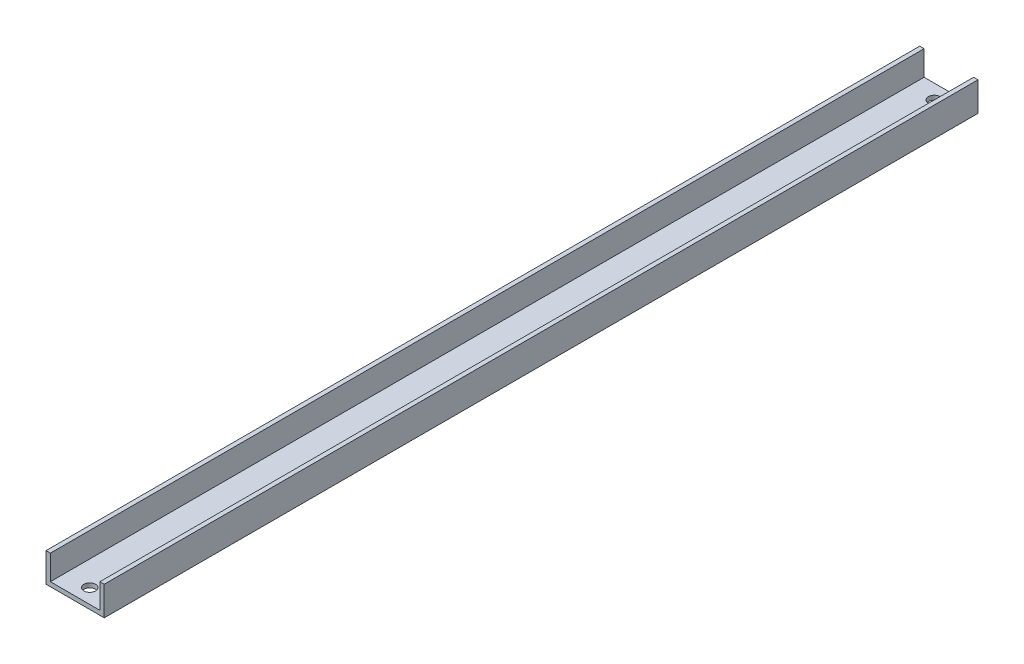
ISO-10303-21;
HEADER;
FILE_DESCRIPTION(('STEP AP214'),'2;1');
FILE_NAME('part.step','',(''),(''),'','','');
FILE_SCHEMA(('AUTOMOTIVE_DESIGN { 1 0 10303 214 1 1 1 1 }'));
ENDSEC;
DATA;
#1=APPLICATION_CONTEXT('core data for automotive mechanical design processes');
#2=APPLICATION_PROTOCOL_DEFINITION('international standard','automotive_design',2000,#1);
#3=PRODUCT_CONTEXT('',#1,'mechanical');
#4=PRODUCT('Part','Part','',(#3));
#5=PRODUCT_RELATED_PRODUCT_CATEGORY('part','',(#4));
#6=PRODUCT_DEFINITION_FORMATION('','',#4);
#7=PRODUCT_DEFINITION_CONTEXT('part definition',#1,'design');
#8=PRODUCT_DEFINITION('design','',#6,#7);
#9=PRODUCT_DEFINITION_SHAPE('','',#8);
#10=(LENGTH_UNIT() NAMED_UNIT(*) SI_UNIT(.MILLI.,.METRE.));
#11=(NAMED_UNIT(*) PLANE_ANGLE_UNIT() SI_UNIT($,.RADIAN.));
#12=(NAMED_UNIT(*) SI_UNIT($,.STERADIAN.) SOLID_ANGLE_UNIT());
#13=UNCERTAINTY_MEASURE_WITH_UNIT(LENGTH_MEASURE(1.E-05),#10,'distance_accuracy_value','');
#14=(GEOMETRIC_REPRESENTATION_CONTEXT(3) GLOBAL_UNCERTAINTY_ASSIGNED_CONTEXT((#13)) GLOBAL_UNIT_ASSIGNED_CONTEXT((#10,
#11,#12)) REPRESENTATION_CONTEXT('',''));
#15=CARTESIAN_POINT('',(0.,0.,0.));
#16=DIRECTION('',(0.,0.,1.));
#17=DIRECTION('',(1.,0.,0.));
#18=AXIS2_PLACEMENT_3D('',#15,#16,#17);
#19=CARTESIAN_POINT('',(-10.,0.,300.));
#20=DIRECTION('',(1.,0.,0.));
#21=DIRECTION('',(0.,0.,-1.));
#22=AXIS2_PLACEMENT_3D('',#19,#20,#21);
#23=PLANE('',#22);
#24=DIRECTION('',(0.,-1.,0.));
#25=VECTOR('',#24,1.);
#26=CARTESIAN_POINT('',(-10.,0.,0.));
#27=LINE('',#26,#25);
#28=CARTESIAN_POINT('',(-10.,10.,0.));
#29=VERTEX_POINT('',#28);
#30=CARTESIAN_POINT('',(-10.,0.,0.));
#31=VERTEX_POINT('',#30);
#32=EDGE_CURVE('E96',#29,#31,#27,.T.);
#33=ORIENTED_EDGE('',*,*,#32,.T.);
#34=DIRECTION('',(0.,0.,-1.));
#35=VECTOR('',#34,1.);
#36=CARTESIAN_POINT('',(-10.,0.,300.));
#37=LINE('',#36,#35);
#38=CARTESIAN_POINT('',(-10.,0.,300.));
#39=VERTEX_POINT('',#38);
#40=EDGE_CURVE('E11',#39,#31,#37,.T.);
#41=ORIENTED_EDGE('',*,*,#40,.F.);
#42=DIRECTION('',(0.,-1.,0.));
#43=VECTOR('',#42,1.);
#44=CARTESIAN_POINT('',(-10.,0.,300.));
#45=LINE('',#44,#43);
#46=CARTESIAN_POINT('',(-10.,10.,300.));
#47=VERTEX_POINT('',#46);
#48=EDGE_CURVE('E128',#47,#39,#45,.T.);
#49=ORIENTED_EDGE('',*,*,#48,.F.);
#50=DIRECTION('',(0.,0.,-1.));
#51=VECTOR('',#50,1.);
#52=CARTESIAN_POINT('',(-10.,10.,300.));
#53=LINE('',#52,#51);
#54=EDGE_CURVE('E109',#47,#29,#53,.T.);
#55=ORIENTED_EDGE('',*,*,#54,.T.);
#56=EDGE_LOOP('',(#33,#41,#49,#55));
#57=FACE_BOUND('',#56,.T.);
#58=ADVANCED_FACE('F26',(#57),#23,.F.);
#59=CARTESIAN_POINT('',(10.,0.,300.));
#60=DIRECTION('',(0.,1.,0.));
#61=DIRECTION('',(0.,0.,1.));
#62=AXIS2_PLACEMENT_3D('',#59,#60,#61);
#63=PLANE('',#62);
#64=CARTESIAN_POINT('',(0.,0.,295.));
#65=DIRECTION('',(0.,-1.,0.));
#66=DIRECTION('',(0.,0.,-1.));
#67=AXIS2_PLACEMENT_3D('',#64,#65,#66);
#68=CIRCLE('',#67,2.);
#69=CARTESIAN_POINT('',(0.,0.,293.));
#70=VERTEX_POINT('',#69);
#71=EDGE_CURVE('E228',#70,#70,#68,.T.);
#72=ORIENTED_EDGE('',*,*,#71,.F.);
#73=EDGE_LOOP('',(#72));
#74=FACE_BOUND('',#73,.T.);
#75=CARTESIAN_POINT('',(0.,0.,5.));
#76=DIRECTION('',(0.,-1.,0.));
#77=DIRECTION('',(0.,0.,-1.));
#78=AXIS2_PLACEMENT_3D('',#75,#76,#77);
#79=CIRCLE('',#78,2.);
#80=CARTESIAN_POINT('',(0.,0.,3.));
#81=VERTEX_POINT('',#80);
#82=EDGE_CURVE('E113',#81,#81,#79,.T.);
#83=ORIENTED_EDGE('',*,*,#82,.F.);
#84=EDGE_LOOP('',(#83));
#85=FACE_BOUND('',#84,.T.);
#86=DIRECTION('',(1.,0.,0.));
#87=VECTOR('',#86,1.);
#88=CARTESIAN_POINT('',(10.,0.,0.));
#89=LINE('',#88,#87);
#90=CARTESIAN_POINT('',(10.,0.,0.));
#91=VERTEX_POINT('',#90);
#92=EDGE_CURVE('E92',#31,#91,#89,.T.);
#93=ORIENTED_EDGE('',*,*,#92,.T.);
#94=DIRECTION('',(0.,0.,-1.));
#95=VECTOR('',#94,1.);
#96=CARTESIAN_POINT('',(10.,0.,300.));
#97=LINE('',#96,#95);
#98=CARTESIAN_POINT('',(10.,0.,300.));
#99=VERTEX_POINT('',#98);
#100=EDGE_CURVE('E34',#99,#91,#97,.T.);
#101=ORIENTED_EDGE('',*,*,#100,.F.);
#102=DIRECTION('',(1.,0.,0.));
#103=VECTOR('',#102,1.);
#104=CARTESIAN_POINT('',(10.,0.,300.));
#105=LINE('',#104,#103);
#106=EDGE_CURVE('E105',#39,#99,#105,.T.);
#107=ORIENTED_EDGE('',*,*,#106,.F.);
#108=ORIENTED_EDGE('',*,*,#40,.T.);
#109=EDGE_LOOP('',(#93,#101,#107,#108));
#110=FACE_BOUND('',#109,.T.);
#111=ADVANCED_FACE('F104',(#74,#85,#110),#63,.F.);
#112=CARTESIAN_POINT('',(10.,0.,300.));
#113=DIRECTION('',(-1.,0.,0.));
#114=DIRECTION('',(0.,0.,1.));
#115=AXIS2_PLACEMENT_3D('',#112,#113,#114);
#116=PLANE('',#115);
#117=DIRECTION('',(0.,1.,0.));
#118=VECTOR('',#117,1.);
#119=CARTESIAN_POINT('',(10.,0.,0.));
#120=LINE('',#119,#118);
#121=CARTESIAN_POINT('',(10.,10.,0.));
#122=VERTEX_POINT('',#121);
#123=EDGE_CURVE('E98',#91,#122,#120,.T.);
#124=ORIENTED_EDGE('',*,*,#123,.T.);
#125=DIRECTION('',(0.,0.,-1.));
#126=VECTOR('',#125,1.);
#127=CARTESIAN_POINT('',(10.,10.,300.));
#128=LINE('',#127,#126);
#129=CARTESIAN_POINT('',(10.,10.,300.));
#130=VERTEX_POINT('',#129);
#131=EDGE_CURVE('E154',#130,#122,#128,.T.);
#132=ORIENTED_EDGE('',*,*,#131,.F.);
#133=DIRECTION('',(0.,1.,0.));
#134=VECTOR('',#133,1.);
#135=CARTESIAN_POINT('',(10.,0.,300.));
#136=LINE('',#135,#134);
#137=EDGE_CURVE('E131',#99,#130,#136,.T.);
#138=ORIENTED_EDGE('',*,*,#137,.F.);
#139=ORIENTED_EDGE('',*,*,#100,.T.);
#140=EDGE_LOOP('',(#124,#132,#138,#139));
#141=FACE_BOUND('',#140,.T.);
#142=ADVANCED_FACE('F159',(#141),#116,.F.);
#143=CARTESIAN_POINT('',(10.,10.,300.));
#144=DIRECTION('',(0.,-1.,0.));
#145=DIRECTION('',(0.,0.,-1.));
#146=AXIS2_PLACEMENT_3D('',#143,#144,#145);
#147=PLANE('',#146);
#148=DIRECTION('',(-1.,0.,0.));
#149=VECTOR('',#148,1.);
#150=CARTESIAN_POINT('',(10.,10.,0.));
#151=LINE('',#150,#149);
#152=CARTESIAN_POINT('',(8.5,10.,0.));
#153=VERTEX_POINT('',#152);
#154=EDGE_CURVE('E118',#122,#153,#151,.T.);
#155=ORIENTED_EDGE('',*,*,#154,.T.);
#156=DIRECTION('',(0.,0.,-1.));
#157=VECTOR('',#156,1.);
#158=CARTESIAN_POINT('',(8.5,10.,300.));
#159=LINE('',#158,#157);
#160=CARTESIAN_POINT('',(8.5,10.,300.));
#161=VERTEX_POINT('',#160);
#162=EDGE_CURVE('E151',#161,#153,#159,.T.);
#163=ORIENTED_EDGE('',*,*,#162,.F.);
#164=DIRECTION('',(-1.,0.,0.));
#165=VECTOR('',#164,1.);
#166=CARTESIAN_POINT('',(10.,10.,300.));
#167=LINE('',#166,#165);
#168=EDGE_CURVE('E133',#130,#161,#167,.T.);
#169=ORIENTED_EDGE('',*,*,#168,.F.);
#170=ORIENTED_EDGE('',*,*,#131,.T.);
#171=EDGE_LOOP('',(#155,#163,#169,#170));
#172=FACE_BOUND('',#171,.T.);
#173=ADVANCED_FACE('F167',(#172),#147,.F.);
#174=CARTESIAN_POINT('',(8.5,1.5,300.));
#175=DIRECTION('',(1.,0.,0.));
#176=DIRECTION('',(0.,0.,-1.));
#177=AXIS2_PLACEMENT_3D('',#174,#175,#176);
#178=PLANE('',#177);
#179=DIRECTION('',(0.,-1.,0.));
#180=VECTOR('',#179,1.);
#181=CARTESIAN_POINT('',(8.5,1.5,0.));
#182=LINE('',#181,#180);
#183=CARTESIAN_POINT('',(8.5,1.5,0.));
#184=VERTEX_POINT('',#183);
#185=EDGE_CURVE('E120',#153,#184,#182,.T.);
#186=ORIENTED_EDGE('',*,*,#185,.T.);
#187=DIRECTION('',(0.,0.,-1.));
#188=VECTOR('',#187,1.);
#189=CARTESIAN_POINT('',(8.5,1.5,300.));
#190=LINE('',#189,#188);
#191=CARTESIAN_POINT('',(8.5,1.5,300.));
#192=VERTEX_POINT('',#191);
#193=EDGE_CURVE('E148',#192,#184,#190,.T.);
#194=ORIENTED_EDGE('',*,*,#193,.F.);
#195=DIRECTION('',(0.,-1.,0.));
#196=VECTOR('',#195,1.);
#197=CARTESIAN_POINT('',(8.5,1.5,300.));
#198=LINE('',#197,#196);
#199=EDGE_CURVE('E135',#161,#192,#198,.T.);
#200=ORIENTED_EDGE('',*,*,#199,.F.);
#201=ORIENTED_EDGE('',*,*,#162,.T.);
#202=EDGE_LOOP('',(#186,#194,#200,#201));
#203=FACE_BOUND('',#202,.T.);
#204=ADVANCED_FACE('F170',(#203),#178,.F.);
#205=CARTESIAN_POINT('',(8.5,1.5,300.));
#206=DIRECTION('',(0.,-1.,0.));
#207=DIRECTION('',(0.,0.,-1.));
#208=AXIS2_PLACEMENT_3D('',#205,#206,#207);
#209=PLANE('',#208);
#210=CARTESIAN_POINT('',(0.,1.5,295.));
#211=DIRECTION('',(0.,-1.,0.));
#212=DIRECTION('',(0.,0.,-1.));
#213=AXIS2_PLACEMENT_3D('',#210,#211,#212);
#214=CIRCLE('',#213,2.);
#215=CARTESIAN_POINT('',(0.,1.5,293.));
#216=VERTEX_POINT('',#215);
#217=EDGE_CURVE('E29',#216,#216,#214,.T.);
#218=ORIENTED_EDGE('',*,*,#217,.T.);
#219=EDGE_LOOP('',(#218));
#220=FACE_BOUND('',#219,.T.);
#221=CARTESIAN_POINT('',(0.,1.5,5.));
#222=DIRECTION('',(0.,-1.,0.));
#223=DIRECTION('',(0.,0.,-1.));
#224=AXIS2_PLACEMENT_3D('',#221,#222,#223);
#225=CIRCLE('',#224,2.);
#226=CARTESIAN_POINT('',(0.,1.5,3.));
#227=VERTEX_POINT('',#226);
#228=EDGE_CURVE('E110',#227,#227,#225,.T.);
#229=ORIENTED_EDGE('',*,*,#228,.T.);
#230=EDGE_LOOP('',(#229));
#231=FACE_BOUND('',#230,.T.);
#232=DIRECTION('',(-1.,0.,0.));
#233=VECTOR('',#232,1.);
#234=CARTESIAN_POINT('',(8.5,1.5,0.));
#235=LINE('',#234,#233);
#236=CARTESIAN_POINT('',(-8.5,1.5,0.));
#237=VERTEX_POINT('',#236);
#238=EDGE_CURVE('E122',#184,#237,#235,.T.);
#239=ORIENTED_EDGE('',*,*,#238,.T.);
#240=DIRECTION('',(0.,0.,-1.));
#241=VECTOR('',#240,1.);
#242=CARTESIAN_POINT('',(-8.5,1.5,300.));
#243=LINE('',#242,#241);
#244=CARTESIAN_POINT('',(-8.5,1.5,300.));
#245=VERTEX_POINT('',#244);
#246=EDGE_CURVE('E145',#245,#237,#243,.T.);
#247=ORIENTED_EDGE('',*,*,#246,.F.);
#248=DIRECTION('',(-1.,0.,0.));
#249=VECTOR('',#248,1.);
#250=CARTESIAN_POINT('',(8.5,1.5,300.));
#251=LINE('',#250,#249);
#252=EDGE_CURVE('E137',#192,#245,#251,.T.);
#253=ORIENTED_EDGE('',*,*,#252,.F.);
#254=ORIENTED_EDGE('',*,*,#193,.T.);
#255=EDGE_LOOP('',(#239,#247,#253,#254));
#256=FACE_BOUND('',#255,.T.);
#257=ADVANCED_FACE('F175',(#220,#231,#256),#209,.F.);
#258=CARTESIAN_POINT('',(-8.5,1.5,300.));
#259=DIRECTION('',(-1.,0.,0.));
#260=DIRECTION('',(0.,0.,1.));
#261=AXIS2_PLACEMENT_3D('',#258,#259,#260);
#262=PLANE('',#261);
#263=DIRECTION('',(0.,1.,0.));
#264=VECTOR('',#263,1.);
#265=CARTESIAN_POINT('',(-8.5,1.5,0.));
#266=LINE('',#265,#264);
#267=CARTESIAN_POINT('',(-8.5,10.,0.));
#268=VERTEX_POINT('',#267);
#269=EDGE_CURVE('E124',#237,#268,#266,.T.);
#270=ORIENTED_EDGE('',*,*,#269,.T.);
#271=DIRECTION('',(0.,0.,-1.));
#272=VECTOR('',#271,1.);
#273=CARTESIAN_POINT('',(-8.5,10.,300.));
#274=LINE('',#273,#272);
#275=CARTESIAN_POINT('',(-8.5,10.,300.));
#276=VERTEX_POINT('',#275);
#277=EDGE_CURVE('E142',#276,#268,#274,.T.);
#278=ORIENTED_EDGE('',*,*,#277,.F.);
#279=DIRECTION('',(0.,1.,0.));
#280=VECTOR('',#279,1.);
#281=CARTESIAN_POINT('',(-8.5,1.5,300.));
#282=LINE('',#281,#280);
#283=EDGE_CURVE('E47',#245,#276,#282,.T.);
#284=ORIENTED_EDGE('',*,*,#283,.F.);
#285=ORIENTED_EDGE('',*,*,#246,.T.);
#286=EDGE_LOOP('',(#270,#278,#284,#285));
#287=FACE_BOUND('',#286,.T.);
#288=ADVANCED_FACE('F178',(#287),#262,.F.);
#289=CARTESIAN_POINT('',(-10.,10.,300.));
#290=DIRECTION('',(0.,-1.,0.));
#291=DIRECTION('',(0.,0.,-1.));
#292=AXIS2_PLACEMENT_3D('',#289,#290,#291);
#293=PLANE('',#292);
#294=DIRECTION('',(-1.,0.,0.));
#295=VECTOR('',#294,1.);
#296=CARTESIAN_POINT('',(-10.,10.,0.));
#297=LINE('',#296,#295);
#298=EDGE_CURVE('E126',#268,#29,#297,.T.);
#299=ORIENTED_EDGE('',*,*,#298,.T.);
#300=ORIENTED_EDGE('',*,*,#54,.F.);
#301=DIRECTION('',(-1.,0.,0.));
#302=VECTOR('',#301,1.);
#303=CARTESIAN_POINT('',(-10.,10.,300.));
#304=LINE('',#303,#302);
#305=EDGE_CURVE('E42',#276,#47,#304,.T.);
#306=ORIENTED_EDGE('',*,*,#305,.F.);
#307=ORIENTED_EDGE('',*,*,#277,.T.);
#308=EDGE_LOOP('',(#299,#300,#306,#307));
#309=FACE_BOUND('',#308,.T.);
#310=ADVANCED_FACE('F180',(#309),#293,.F.);
#311=CARTESIAN_POINT('',(-10.,10.,300.));
#312=DIRECTION('',(0.,0.,-1.));
#313=DIRECTION('',(-1.,0.,0.));
#314=AXIS2_PLACEMENT_3D('',#311,#312,#313);
#315=PLANE('',#314);
#316=ORIENTED_EDGE('',*,*,#48,.T.);
#317=ORIENTED_EDGE('',*,*,#106,.T.);
#318=ORIENTED_EDGE('',*,*,#137,.T.);
#319=ORIENTED_EDGE('',*,*,#168,.T.);
#320=ORIENTED_EDGE('',*,*,#199,.T.);
#321=ORIENTED_EDGE('',*,*,#252,.T.);
#322=ORIENTED_EDGE('',*,*,#283,.T.);
#323=ORIENTED_EDGE('',*,*,#305,.T.);
#324=EDGE_LOOP('',(#316,#317,#318,#319,#320,#321,#322,#323));
#325=FACE_BOUND('',#324,.T.);
#326=ADVANCED_FACE('F162',(#325),#315,.F.);
#327=CARTESIAN_POINT('',(-10.,10.,0.));
#328=DIRECTION('',(0.,0.,-1.));
#329=DIRECTION('',(-1.,0.,0.));
#330=AXIS2_PLACEMENT_3D('',#327,#328,#329);
#331=PLANE('',#330);
#332=ORIENTED_EDGE('',*,*,#32,.F.);
#333=ORIENTED_EDGE('',*,*,#298,.F.);
#334=ORIENTED_EDGE('',*,*,#269,.F.);
#335=ORIENTED_EDGE('',*,*,#238,.F.);
#336=ORIENTED_EDGE('',*,*,#185,.F.);
#337=ORIENTED_EDGE('',*,*,#154,.F.);
#338=ORIENTED_EDGE('',*,*,#123,.F.);
#339=ORIENTED_EDGE('',*,*,#92,.F.);
#340=EDGE_LOOP('',(#332,#333,#334,#335,#336,#337,#338,#339));
#341=FACE_BOUND('',#340,.T.);
#342=ADVANCED_FACE('F93',(#341),#331,.T.);
#343=CARTESIAN_POINT('',(0.,10.,5.));
#344=DIRECTION('',(0.,-1.,0.));
#345=DIRECTION('',(0.,0.,-1.));
#346=AXIS2_PLACEMENT_3D('',#343,#344,#345);
#347=CYLINDRICAL_SURFACE('',#346,2.);
#348=ORIENTED_EDGE('',*,*,#82,.T.);
#349=EDGE_LOOP('',(#348));
#350=FACE_BOUND('',#349,.T.);
#351=ORIENTED_EDGE('',*,*,#228,.F.);
#352=EDGE_LOOP('',(#351));
#353=FACE_BOUND('',#352,.T.);
#354=ADVANCED_FACE('F216',(#350,#353),#347,.F.);
#355=CARTESIAN_POINT('',(0.,10.,295.));
#356=DIRECTION('',(0.,-1.,0.));
#357=DIRECTION('',(0.,0.,-1.));
#358=AXIS2_PLACEMENT_3D('',#355,#356,#357);
#359=CYLINDRICAL_SURFACE('',#358,2.);
#360=ORIENTED_EDGE('',*,*,#71,.T.);
#361=EDGE_LOOP('',(#360));
#362=FACE_BOUND('',#361,.T.);
#363=ORIENTED_EDGE('',*,*,#217,.F.);
#364=EDGE_LOOP('',(#363));
#365=FACE_BOUND('',#364,.T.);
#366=ADVANCED_FACE('F217',(#362,#365),#359,.F.);
#367=CLOSED_SHELL('',(#58,#111,#142,#173,#204,#257,#288,#310,#326,#342,#354,#366));
#368=MANIFOLD_SOLID_BREP('B2',#367);
#369=ADVANCED_BREP_SHAPE_REPRESENTATION('',(#18,#368),#14);
#370=SHAPE_DEFINITION_REPRESENTATION(#9,#369);
ENDSEC;
END-ISO-10303-21;
